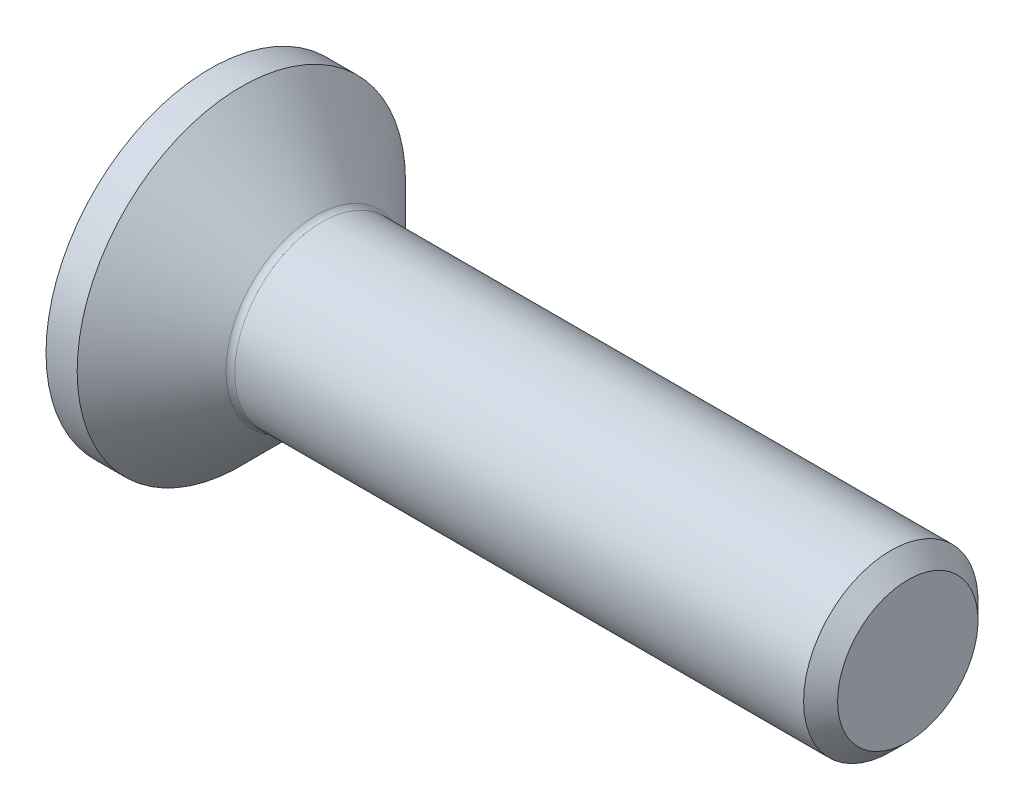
ISO-10303-21;
HEADER;
FILE_DESCRIPTION(('STEP AP214'),'2;1');
FILE_NAME('part.step','',(''),(''),'','','');
FILE_SCHEMA(('AUTOMOTIVE_DESIGN { 1 0 10303 214 1 1 1 1 }'));
ENDSEC;
DATA;
#1=APPLICATION_CONTEXT('core data for automotive mechanical design processes');
#2=APPLICATION_PROTOCOL_DEFINITION('international standard','automotive_design',2000,#1);
#3=PRODUCT_CONTEXT('',#1,'mechanical');
#4=PRODUCT('Part','Part','',(#3));
#5=PRODUCT_RELATED_PRODUCT_CATEGORY('part','',(#4));
#6=PRODUCT_DEFINITION_FORMATION('','',#4);
#7=PRODUCT_DEFINITION_CONTEXT('part definition',#1,'design');
#8=PRODUCT_DEFINITION('design','',#6,#7);
#9=PRODUCT_DEFINITION_SHAPE('','',#8);
#10=(LENGTH_UNIT() NAMED_UNIT(*) SI_UNIT(.MILLI.,.METRE.));
#11=(NAMED_UNIT(*) PLANE_ANGLE_UNIT() SI_UNIT($,.RADIAN.));
#12=(NAMED_UNIT(*) SI_UNIT($,.STERADIAN.) SOLID_ANGLE_UNIT());
#13=UNCERTAINTY_MEASURE_WITH_UNIT(LENGTH_MEASURE(1.E-05),#10,'distance_accuracy_value','');
#14=(GEOMETRIC_REPRESENTATION_CONTEXT(3) GLOBAL_UNCERTAINTY_ASSIGNED_CONTEXT((#13)) GLOBAL_UNIT_ASSIGNED_CONTEXT((#10,
#11,#12)) REPRESENTATION_CONTEXT('',''));
#15=CARTESIAN_POINT('',(0.,0.,0.));
#16=DIRECTION('',(0.,0.,1.));
#17=DIRECTION('',(1.,0.,0.));
#18=AXIS2_PLACEMENT_3D('',#15,#16,#17);
#19=CARTESIAN_POINT('',(0.,0.,0.));
#20=DIRECTION('',(-1.,0.,0.));
#21=DIRECTION('',(0.,0.,1.));
#22=AXIS2_PLACEMENT_3D('',#19,#20,#21);
#23=PLANE('',#22);
#24=CARTESIAN_POINT('',(0.,0.,0.));
#25=DIRECTION('',(-1.,0.,0.));
#26=DIRECTION('',(0.,0.,1.));
#27=AXIS2_PLACEMENT_3D('',#24,#25,#26);
#28=CIRCLE('',#27,3.765);
#29=CARTESIAN_POINT('',(0.,0.,3.765));
#30=VERTEX_POINT('',#29);
#31=EDGE_CURVE('E160',#30,#30,#28,.T.);
#32=ORIENTED_EDGE('',*,*,#31,.T.);
#33=EDGE_LOOP('',(#32));
#34=FACE_BOUND('',#33,.T.);
#35=DIRECTION('',(0.,-0.500000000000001,-0.866025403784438));
#36=VECTOR('',#35,1.);
#37=CARTESIAN_POINT('',(0.,-0.721687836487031,1.25));
#38=LINE('',#37,#36);
#39=CARTESIAN_POINT('',(0.,-0.721687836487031,1.25));
#40=VERTEX_POINT('',#39);
#41=CARTESIAN_POINT('',(0.,-1.44337567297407,0.));
#42=VERTEX_POINT('',#41);
#43=EDGE_CURVE('E122',#40,#42,#38,.T.);
#44=ORIENTED_EDGE('',*,*,#43,.T.);
#45=DIRECTION('',(0.,0.5,-0.866025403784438));
#46=VECTOR('',#45,1.);
#47=CARTESIAN_POINT('',(0.,-1.44337567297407,0.));
#48=LINE('',#47,#46);
#49=CARTESIAN_POINT('',(0.,-0.721687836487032,-1.25));
#50=VERTEX_POINT('',#49);
#51=EDGE_CURVE('E52',#42,#50,#48,.T.);
#52=ORIENTED_EDGE('',*,*,#51,.T.);
#53=DIRECTION('',(0.,1.,0.));
#54=VECTOR('',#53,1.);
#55=CARTESIAN_POINT('',(0.,-0.721687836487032,-1.25));
#56=LINE('',#55,#54);
#57=CARTESIAN_POINT('',(0.,0.721687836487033,-1.25));
#58=VERTEX_POINT('',#57);
#59=EDGE_CURVE('E137',#50,#58,#56,.T.);
#60=ORIENTED_EDGE('',*,*,#59,.T.);
#61=DIRECTION('',(0.,0.500000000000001,0.866025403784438));
#62=VECTOR('',#61,1.);
#63=CARTESIAN_POINT('',(0.,0.721687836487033,-1.25));
#64=LINE('',#63,#62);
#65=CARTESIAN_POINT('',(0.,1.44337567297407,0.));
#66=VERTEX_POINT('',#65);
#67=EDGE_CURVE('E273',#58,#66,#64,.T.);
#68=ORIENTED_EDGE('',*,*,#67,.T.);
#69=DIRECTION('',(0.,-0.5,0.866025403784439));
#70=VECTOR('',#69,1.);
#71=CARTESIAN_POINT('',(0.,1.44337567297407,0.));
#72=LINE('',#71,#70);
#73=CARTESIAN_POINT('',(0.,0.721687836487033,1.25));
#74=VERTEX_POINT('',#73);
#75=EDGE_CURVE('E276',#66,#74,#72,.T.);
#76=ORIENTED_EDGE('',*,*,#75,.T.);
#77=DIRECTION('',(0.,-1.,0.));
#78=VECTOR('',#77,1.);
#79=CARTESIAN_POINT('',(0.,0.721687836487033,1.25));
#80=LINE('',#79,#78);
#81=EDGE_CURVE('E279',#74,#40,#80,.T.);
#82=ORIENTED_EDGE('',*,*,#81,.T.);
#83=EDGE_LOOP('',(#44,#52,#60,#68,#76,#82));
#84=FACE_BOUND('',#83,.T.);
#85=ADVANCED_FACE('F37',(#34,#84),#23,.T.);
#86=CARTESIAN_POINT('',(0.,0.,0.));
#87=DIRECTION('',(-1.,0.,0.));
#88=DIRECTION('',(0.,0.,1.));
#89=AXIS2_PLACEMENT_3D('',#86,#87,#88);
#90=CYLINDRICAL_SURFACE('',#89,3.765);
#91=CARTESIAN_POINT('',(0.715000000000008,0.,0.));
#92=DIRECTION('',(-1.,0.,0.));
#93=DIRECTION('',(0.,0.,1.));
#94=AXIS2_PLACEMENT_3D('',#91,#92,#93);
#95=CIRCLE('',#94,3.765);
#96=CARTESIAN_POINT('',(0.715000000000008,0.,3.765));
#97=VERTEX_POINT('',#96);
#98=EDGE_CURVE('E157',#97,#97,#95,.T.);
#99=ORIENTED_EDGE('',*,*,#98,.T.);
#100=EDGE_LOOP('',(#99));
#101=FACE_BOUND('',#100,.T.);
#102=ORIENTED_EDGE('',*,*,#31,.F.);
#103=EDGE_LOOP('',(#102));
#104=FACE_BOUND('',#103,.T.);
#105=ADVANCED_FACE('F181',(#101,#104),#90,.T.);
#106=CARTESIAN_POINT('',(0.715000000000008,0.,0.));
#107=DIRECTION('',(-1.,0.,0.));
#108=DIRECTION('',(0.,0.,1.));
#109=AXIS2_PLACEMENT_3D('',#106,#107,#108);
#110=CONICAL_SURFACE('',#109,3.765,0.785398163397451);
#111=CARTESIAN_POINT('',(2.42142135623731,0.,0.));
#112=DIRECTION('',(-1.,0.,0.));
#113=DIRECTION('',(0.,0.,1.));
#114=AXIS2_PLACEMENT_3D('',#111,#112,#113);
#115=CIRCLE('',#114,2.05857864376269);
#116=CARTESIAN_POINT('',(2.42142135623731,0.,2.05857864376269));
#117=VERTEX_POINT('',#116);
#118=EDGE_CURVE('E45',#117,#117,#115,.T.);
#119=ORIENTED_EDGE('',*,*,#118,.T.);
#120=EDGE_LOOP('',(#119));
#121=FACE_BOUND('',#120,.T.);
#122=ORIENTED_EDGE('',*,*,#98,.F.);
#123=EDGE_LOOP('',(#122));
#124=FACE_BOUND('',#123,.T.);
#125=ADVANCED_FACE('F165',(#121,#124),#110,.T.);
#126=CARTESIAN_POINT('',(0.,0.,0.));
#127=DIRECTION('',(-1.,0.,0.));
#128=DIRECTION('',(0.,0.,1.));
#129=AXIS2_PLACEMENT_3D('',#126,#127,#128);
#130=CYLINDRICAL_SURFACE('',#129,2.);
#131=CARTESIAN_POINT('',(2.56284271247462,0.,0.));
#132=DIRECTION('',(-1.,0.,0.));
#133=DIRECTION('',(0.,0.,1.));
#134=AXIS2_PLACEMENT_3D('',#131,#132,#133);
#135=CIRCLE('',#134,2.);
#136=CARTESIAN_POINT('',(2.56284271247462,0.,2.));
#137=VERTEX_POINT('',#136);
#138=EDGE_CURVE('E11',#137,#137,#135,.F.);
#139=ORIENTED_EDGE('',*,*,#138,.T.);
#140=EDGE_LOOP('',(#139));
#141=FACE_BOUND('',#140,.T.);
#142=CARTESIAN_POINT('',(15.61,0.,0.));
#143=DIRECTION('',(-1.,0.,0.));
#144=DIRECTION('',(0.,0.,1.));
#145=AXIS2_PLACEMENT_3D('',#142,#143,#144);
#146=CIRCLE('',#145,2.);
#147=CARTESIAN_POINT('',(15.61,0.,2.));
#148=VERTEX_POINT('',#147);
#149=EDGE_CURVE('E154',#148,#148,#146,.T.);
#150=ORIENTED_EDGE('',*,*,#149,.T.);
#151=EDGE_LOOP('',(#150));
#152=FACE_BOUND('',#151,.T.);
#153=ADVANCED_FACE('F192',(#141,#152),#130,.T.);
#154=CARTESIAN_POINT('',(16.,0.,0.));
#155=DIRECTION('',(-1.,0.,0.));
#156=DIRECTION('',(0.,0.,1.));
#157=AXIS2_PLACEMENT_3D('',#154,#155,#156);
#158=CONICAL_SURFACE('',#157,1.61,0.785398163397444);
#159=ORIENTED_EDGE('',*,*,#149,.F.);
#160=EDGE_LOOP('',(#159));
#161=FACE_BOUND('',#160,.T.);
#162=CARTESIAN_POINT('',(16.,0.,0.));
#163=DIRECTION('',(-1.,0.,0.));
#164=DIRECTION('',(0.,0.,1.));
#165=AXIS2_PLACEMENT_3D('',#162,#163,#164);
#166=CIRCLE('',#165,1.61);
#167=CARTESIAN_POINT('',(16.,0.,1.61));
#168=VERTEX_POINT('',#167);
#169=EDGE_CURVE('E150',#168,#168,#166,.T.);
#170=ORIENTED_EDGE('',*,*,#169,.T.);
#171=EDGE_LOOP('',(#170));
#172=FACE_BOUND('',#171,.T.);
#173=ADVANCED_FACE('F176',(#161,#172),#158,.T.);
#174=CARTESIAN_POINT('',(16.,1.61,0.));
#175=DIRECTION('',(1.,0.,0.));
#176=DIRECTION('',(0.,0.,-1.));
#177=AXIS2_PLACEMENT_3D('',#174,#175,#176);
#178=PLANE('',#177);
#179=ORIENTED_EDGE('',*,*,#169,.F.);
#180=EDGE_LOOP('',(#179));
#181=FACE_BOUND('',#180,.T.);
#182=ADVANCED_FACE('F169',(#181),#178,.T.);
#183=CARTESIAN_POINT('',(2.56284271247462,0.,0.));
#184=DIRECTION('',(-1.,0.,0.));
#185=DIRECTION('',(0.,0.,1.));
#186=AXIS2_PLACEMENT_3D('',#183,#184,#185);
#187=TOROIDAL_SURFACE('',#186,2.2,0.2);
#188=ORIENTED_EDGE('',*,*,#138,.F.);
#189=EDGE_LOOP('',(#188));
#190=FACE_BOUND('',#189,.T.);
#191=ORIENTED_EDGE('',*,*,#118,.F.);
#192=EDGE_LOOP('',(#191));
#193=FACE_BOUND('',#192,.T.);
#194=ADVANCED_FACE('F39',(#190,#193),#187,.F.);
#195=CARTESIAN_POINT('',(1.5,-1.44337567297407,0.));
#196=DIRECTION('',(0.,0.866025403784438,0.500000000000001));
#197=DIRECTION('',(0.,-0.500000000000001,0.866025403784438));
#198=AXIS2_PLACEMENT_3D('',#195,#196,#197);
#199=PLANE('',#198);
#200=ORIENTED_EDGE('',*,*,#51,.F.);
#201=DIRECTION('',(-1.,0.,0.));
#202=VECTOR('',#201,1.);
#203=CARTESIAN_POINT('',(1.5,-1.44337567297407,0.));
#204=LINE('',#203,#202);
#205=CARTESIAN_POINT('',(1.5,-1.44337567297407,0.));
#206=VERTEX_POINT('',#205);
#207=EDGE_CURVE('E270',#206,#42,#204,.T.);
#208=ORIENTED_EDGE('',*,*,#207,.F.);
#209=DIRECTION('',(0.,0.5,-0.866025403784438));
#210=VECTOR('',#209,1.);
#211=CARTESIAN_POINT('',(1.5,-1.44337567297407,0.));
#212=LINE('',#211,#210);
#213=CARTESIAN_POINT('',(1.5,-1.08253175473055,-0.625000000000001));
#214=VERTEX_POINT('',#213);
#215=EDGE_CURVE('E119',#206,#214,#212,.T.);
#216=ORIENTED_EDGE('',*,*,#215,.T.);
#217=CARTESIAN_POINT('',(1.5,-0.721687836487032,-1.25));
#218=VERTEX_POINT('',#217);
#219=EDGE_CURVE('E113',#214,#218,#212,.T.);
#220=ORIENTED_EDGE('',*,*,#219,.T.);
#221=DIRECTION('',(-1.,0.,0.));
#222=VECTOR('',#221,1.);
#223=CARTESIAN_POINT('',(1.5,-0.721687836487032,-1.25));
#224=LINE('',#223,#222);
#225=EDGE_CURVE('E117',#218,#50,#224,.T.);
#226=ORIENTED_EDGE('',*,*,#225,.T.);
#227=EDGE_LOOP('',(#200,#208,#216,#220,#226));
#228=FACE_BOUND('',#227,.T.);
#229=ADVANCED_FACE('F115',(#228),#199,.T.);
#230=CARTESIAN_POINT('',(1.5,-0.721687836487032,-1.25));
#231=DIRECTION('',(0.,0.,1.));
#232=DIRECTION('',(0.,-1.,0.));
#233=AXIS2_PLACEMENT_3D('',#230,#231,#232);
#234=PLANE('',#233);
#235=ORIENTED_EDGE('',*,*,#59,.F.);
#236=ORIENTED_EDGE('',*,*,#225,.F.);
#237=DIRECTION('',(0.,1.,0.));
#238=VECTOR('',#237,1.);
#239=CARTESIAN_POINT('',(1.5,-0.721687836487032,-1.25));
#240=LINE('',#239,#238);
#241=CARTESIAN_POINT('',(1.5,0.,-1.25));
#242=VERTEX_POINT('',#241);
#243=EDGE_CURVE('E125',#218,#242,#240,.T.);
#244=ORIENTED_EDGE('',*,*,#243,.T.);
#245=CARTESIAN_POINT('',(1.5,0.721687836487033,-1.25));
#246=VERTEX_POINT('',#245);
#247=EDGE_CURVE('E132',#242,#246,#240,.T.);
#248=ORIENTED_EDGE('',*,*,#247,.T.);
#249=DIRECTION('',(-1.,0.,0.));
#250=VECTOR('',#249,1.);
#251=CARTESIAN_POINT('',(1.5,0.721687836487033,-1.25));
#252=LINE('',#251,#250);
#253=EDGE_CURVE('E139',#246,#58,#252,.T.);
#254=ORIENTED_EDGE('',*,*,#253,.T.);
#255=EDGE_LOOP('',(#235,#236,#244,#248,#254));
#256=FACE_BOUND('',#255,.T.);
#257=ADVANCED_FACE('F134',(#256),#234,.T.);
#258=CARTESIAN_POINT('',(1.5,0.721687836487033,-1.25));
#259=DIRECTION('',(0.,-0.866025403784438,0.5));
#260=DIRECTION('',(0.,-0.500000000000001,-0.866025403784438));
#261=AXIS2_PLACEMENT_3D('',#258,#259,#260);
#262=PLANE('',#261);
#263=ORIENTED_EDGE('',*,*,#67,.F.);
#264=ORIENTED_EDGE('',*,*,#253,.F.);
#265=DIRECTION('',(0.,0.500000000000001,0.866025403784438));
#266=VECTOR('',#265,1.);
#267=CARTESIAN_POINT('',(1.5,0.721687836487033,-1.25));
#268=LINE('',#267,#266);
#269=CARTESIAN_POINT('',(1.5,1.08253175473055,-0.625000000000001));
#270=VERTEX_POINT('',#269);
#271=EDGE_CURVE('E262',#246,#270,#268,.T.);
#272=ORIENTED_EDGE('',*,*,#271,.T.);
#273=CARTESIAN_POINT('',(1.5,1.44337567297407,0.));
#274=VERTEX_POINT('',#273);
#275=EDGE_CURVE('E131',#270,#274,#268,.T.);
#276=ORIENTED_EDGE('',*,*,#275,.T.);
#277=DIRECTION('',(-1.,0.,0.));
#278=VECTOR('',#277,1.);
#279=CARTESIAN_POINT('',(1.5,1.44337567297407,0.));
#280=LINE('',#279,#278);
#281=EDGE_CURVE('E145',#274,#66,#280,.T.);
#282=ORIENTED_EDGE('',*,*,#281,.T.);
#283=EDGE_LOOP('',(#263,#264,#272,#276,#282));
#284=FACE_BOUND('',#283,.T.);
#285=ADVANCED_FACE('F206',(#284),#262,.T.);
#286=CARTESIAN_POINT('',(1.5,1.44337567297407,0.));
#287=DIRECTION('',(0.,-0.866025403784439,-0.5));
#288=DIRECTION('',(0.,0.5,-0.866025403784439));
#289=AXIS2_PLACEMENT_3D('',#286,#287,#288);
#290=PLANE('',#289);
#291=ORIENTED_EDGE('',*,*,#75,.F.);
#292=ORIENTED_EDGE('',*,*,#281,.F.);
#293=DIRECTION('',(0.,-0.5,0.866025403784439));
#294=VECTOR('',#293,1.);
#295=CARTESIAN_POINT('',(1.5,1.44337567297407,0.));
#296=LINE('',#295,#294);
#297=CARTESIAN_POINT('',(1.5,1.08253175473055,0.625));
#298=VERTEX_POINT('',#297);
#299=EDGE_CURVE('E60',#274,#298,#296,.T.);
#300=ORIENTED_EDGE('',*,*,#299,.T.);
#301=CARTESIAN_POINT('',(1.5,0.721687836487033,1.25));
#302=VERTEX_POINT('',#301);
#303=EDGE_CURVE('E241',#298,#302,#296,.T.);
#304=ORIENTED_EDGE('',*,*,#303,.T.);
#305=DIRECTION('',(-1.,0.,0.));
#306=VECTOR('',#305,1.);
#307=CARTESIAN_POINT('',(1.5,0.721687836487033,1.25));
#308=LINE('',#307,#306);
#309=EDGE_CURVE('E255',#302,#74,#308,.T.);
#310=ORIENTED_EDGE('',*,*,#309,.T.);
#311=EDGE_LOOP('',(#291,#292,#300,#304,#310));
#312=FACE_BOUND('',#311,.T.);
#313=ADVANCED_FACE('F209',(#312),#290,.T.);
#314=CARTESIAN_POINT('',(1.5,0.721687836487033,1.25));
#315=DIRECTION('',(0.,0.,-1.));
#316=DIRECTION('',(0.,1.,0.));
#317=AXIS2_PLACEMENT_3D('',#314,#315,#316);
#318=PLANE('',#317);
#319=ORIENTED_EDGE('',*,*,#81,.F.);
#320=ORIENTED_EDGE('',*,*,#309,.F.);
#321=DIRECTION('',(0.,-1.,0.));
#322=VECTOR('',#321,1.);
#323=CARTESIAN_POINT('',(1.5,0.721687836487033,1.25));
#324=LINE('',#323,#322);
#325=CARTESIAN_POINT('',(1.5,0.,1.25));
#326=VERTEX_POINT('',#325);
#327=EDGE_CURVE('E240',#302,#326,#324,.T.);
#328=ORIENTED_EDGE('',*,*,#327,.T.);
#329=CARTESIAN_POINT('',(1.5,-0.721687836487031,1.25));
#330=VERTEX_POINT('',#329);
#331=EDGE_CURVE('E246',#326,#330,#324,.T.);
#332=ORIENTED_EDGE('',*,*,#331,.T.);
#333=DIRECTION('',(-1.,0.,0.));
#334=VECTOR('',#333,1.);
#335=CARTESIAN_POINT('',(1.5,-0.721687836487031,1.25));
#336=LINE('',#335,#334);
#337=EDGE_CURVE('E285',#330,#40,#336,.T.);
#338=ORIENTED_EDGE('',*,*,#337,.T.);
#339=EDGE_LOOP('',(#319,#320,#328,#332,#338));
#340=FACE_BOUND('',#339,.T.);
#341=ADVANCED_FACE('F213',(#340),#318,.T.);
#342=CARTESIAN_POINT('',(1.5,-0.721687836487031,1.25));
#343=DIRECTION('',(0.,0.866025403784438,-0.500000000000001));
#344=DIRECTION('',(0.,0.500000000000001,0.866025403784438));
#345=AXIS2_PLACEMENT_3D('',#342,#343,#344);
#346=PLANE('',#345);
#347=ORIENTED_EDGE('',*,*,#43,.F.);
#348=ORIENTED_EDGE('',*,*,#337,.F.);
#349=DIRECTION('',(0.,-0.500000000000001,-0.866025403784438));
#350=VECTOR('',#349,1.);
#351=CARTESIAN_POINT('',(1.5,-0.721687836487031,1.25));
#352=LINE('',#351,#350);
#353=CARTESIAN_POINT('',(1.5,-1.08253175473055,0.625000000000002));
#354=VERTEX_POINT('',#353);
#355=EDGE_CURVE('E249',#330,#354,#352,.T.);
#356=ORIENTED_EDGE('',*,*,#355,.T.);
#357=EDGE_CURVE('E256',#354,#206,#352,.T.);
#358=ORIENTED_EDGE('',*,*,#357,.T.);
#359=ORIENTED_EDGE('',*,*,#207,.T.);
#360=EDGE_LOOP('',(#347,#348,#356,#358,#359));
#361=FACE_BOUND('',#360,.T.);
#362=ADVANCED_FACE('F216',(#361),#346,.T.);
#363=CARTESIAN_POINT('',(1.5,-1.44337567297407,0.));
#364=DIRECTION('',(-1.,0.,0.));
#365=DIRECTION('',(0.,0.,1.));
#366=AXIS2_PLACEMENT_3D('',#363,#364,#365);
#367=PLANE('',#366);
#368=CARTESIAN_POINT('',(1.5,0.,0.));
#369=DIRECTION('',(-1.,0.,0.));
#370=DIRECTION('',(0.,0.,1.));
#371=AXIS2_PLACEMENT_3D('',#368,#369,#370);
#372=CIRCLE('',#371,1.25);
#373=EDGE_CURVE('E138',#354,#326,#372,.T.);
#374=ORIENTED_EDGE('',*,*,#373,.F.);
#375=ORIENTED_EDGE('',*,*,#355,.F.);
#376=ORIENTED_EDGE('',*,*,#331,.F.);
#377=EDGE_LOOP('',(#374,#375,#376));
#378=FACE_BOUND('',#377,.T.);
#379=ADVANCED_FACE('F220',(#378),#367,.T.);
#380=EDGE_CURVE('E142',#214,#354,#372,.T.);
#381=ORIENTED_EDGE('',*,*,#380,.F.);
#382=ORIENTED_EDGE('',*,*,#215,.F.);
#383=ORIENTED_EDGE('',*,*,#357,.F.);
#384=EDGE_LOOP('',(#381,#382,#383));
#385=FACE_BOUND('',#384,.T.);
#386=ADVANCED_FACE('F223',(#385),#367,.T.);
#387=EDGE_CURVE('E127',#242,#214,#372,.T.);
#388=ORIENTED_EDGE('',*,*,#387,.F.);
#389=ORIENTED_EDGE('',*,*,#243,.F.);
#390=ORIENTED_EDGE('',*,*,#219,.F.);
#391=EDGE_LOOP('',(#388,#389,#390));
#392=FACE_BOUND('',#391,.T.);
#393=ADVANCED_FACE('F126',(#392),#367,.T.);
#394=EDGE_CURVE('E258',#270,#242,#372,.T.);
#395=ORIENTED_EDGE('',*,*,#394,.F.);
#396=ORIENTED_EDGE('',*,*,#271,.F.);
#397=ORIENTED_EDGE('',*,*,#247,.F.);
#398=EDGE_LOOP('',(#395,#396,#397));
#399=FACE_BOUND('',#398,.T.);
#400=ADVANCED_FACE('F235',(#399),#367,.T.);
#401=EDGE_CURVE('E151',#298,#270,#372,.T.);
#402=ORIENTED_EDGE('',*,*,#401,.F.);
#403=ORIENTED_EDGE('',*,*,#299,.F.);
#404=ORIENTED_EDGE('',*,*,#275,.F.);
#405=EDGE_LOOP('',(#402,#403,#404));
#406=FACE_BOUND('',#405,.T.);
#407=ADVANCED_FACE('F230',(#406),#367,.T.);
#408=EDGE_CURVE('E144',#326,#298,#372,.T.);
#409=ORIENTED_EDGE('',*,*,#408,.F.);
#410=ORIENTED_EDGE('',*,*,#327,.F.);
#411=ORIENTED_EDGE('',*,*,#303,.F.);
#412=EDGE_LOOP('',(#409,#410,#411));
#413=FACE_BOUND('',#412,.T.);
#414=ADVANCED_FACE('F201',(#413),#367,.T.);
#415=CARTESIAN_POINT('',(1.5,0.,0.));
#416=DIRECTION('',(-1.,0.,0.));
#417=DIRECTION('',(0.,0.,1.));
#418=AXIS2_PLACEMENT_3D('',#415,#416,#417);
#419=CONICAL_SURFACE('',#418,1.25,1.04719755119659);
#420=CARTESIAN_POINT('',(2.22168783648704,0.,0.));
#421=VERTEX_POINT('',#420);
#422=VERTEX_LOOP('',#421);
#423=FACE_BOUND('',#422,.T.);
#424=ORIENTED_EDGE('',*,*,#408,.T.);
#425=ORIENTED_EDGE('',*,*,#401,.T.);
#426=ORIENTED_EDGE('',*,*,#394,.T.);
#427=ORIENTED_EDGE('',*,*,#387,.T.);
#428=ORIENTED_EDGE('',*,*,#380,.T.);
#429=ORIENTED_EDGE('',*,*,#373,.T.);
#430=EDGE_LOOP('',(#424,#425,#426,#427,#428,#429));
#431=FACE_BOUND('',#430,.T.);
#432=ADVANCED_FACE('F199',(#423,#431),#419,.F.);
#433=CLOSED_SHELL('',(#85,#105,#125,#153,#173,#182,#194,#229,#257,#285,#313,#341,#362,#379,#386,
#393,#400,#407,#414,#432));
#434=MANIFOLD_SOLID_BREP('B2',#433);
#435=ADVANCED_BREP_SHAPE_REPRESENTATION('',(#18,#434),#14);
#436=SHAPE_DEFINITION_REPRESENTATION(#9,#435);
ENDSEC;
END-ISO-10303-21;
